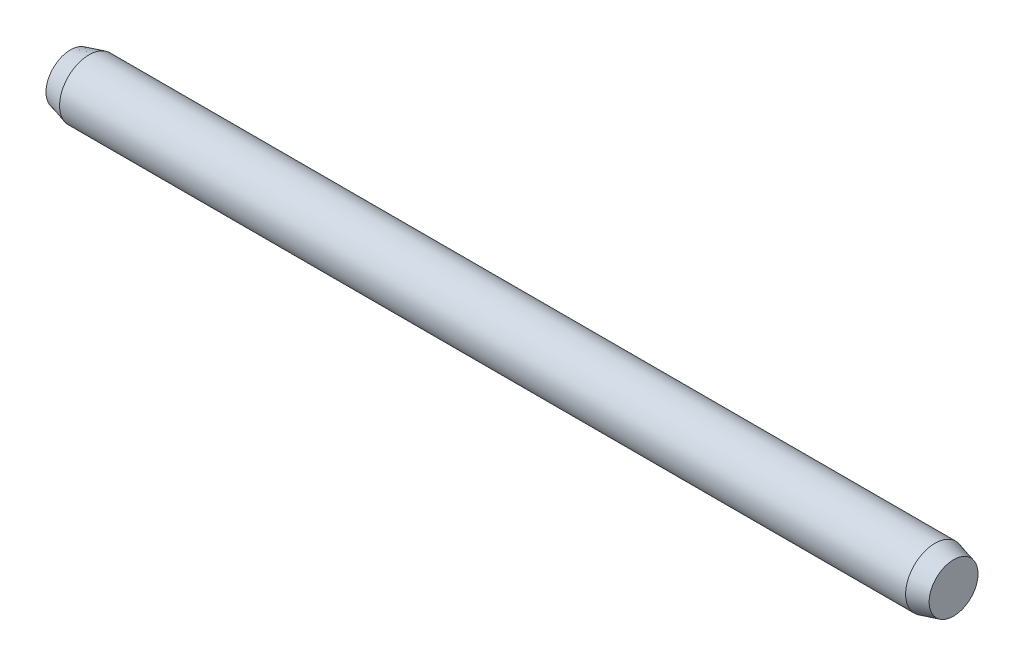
from build123d import *


with BuildPart() as part:
    # Sketch1 → Base-Revolve (revolve)
    with BuildSketch(Plane.XY, mode=Mode.PRIVATE) as base_revolve_sk:
        Polygon((0, 0), (30, 0), (30, 0.831192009), (29.37, 1), (0.63, 1), (0, 0.831192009), align=None)
    revolve(base_revolve_sk.sketch.rotate(Axis((-6.35, 0, 0), (1, 0, 0)), 90), axis=Axis((-6.35, 0, 0), (1, 0, 0)))


solid = part.part
